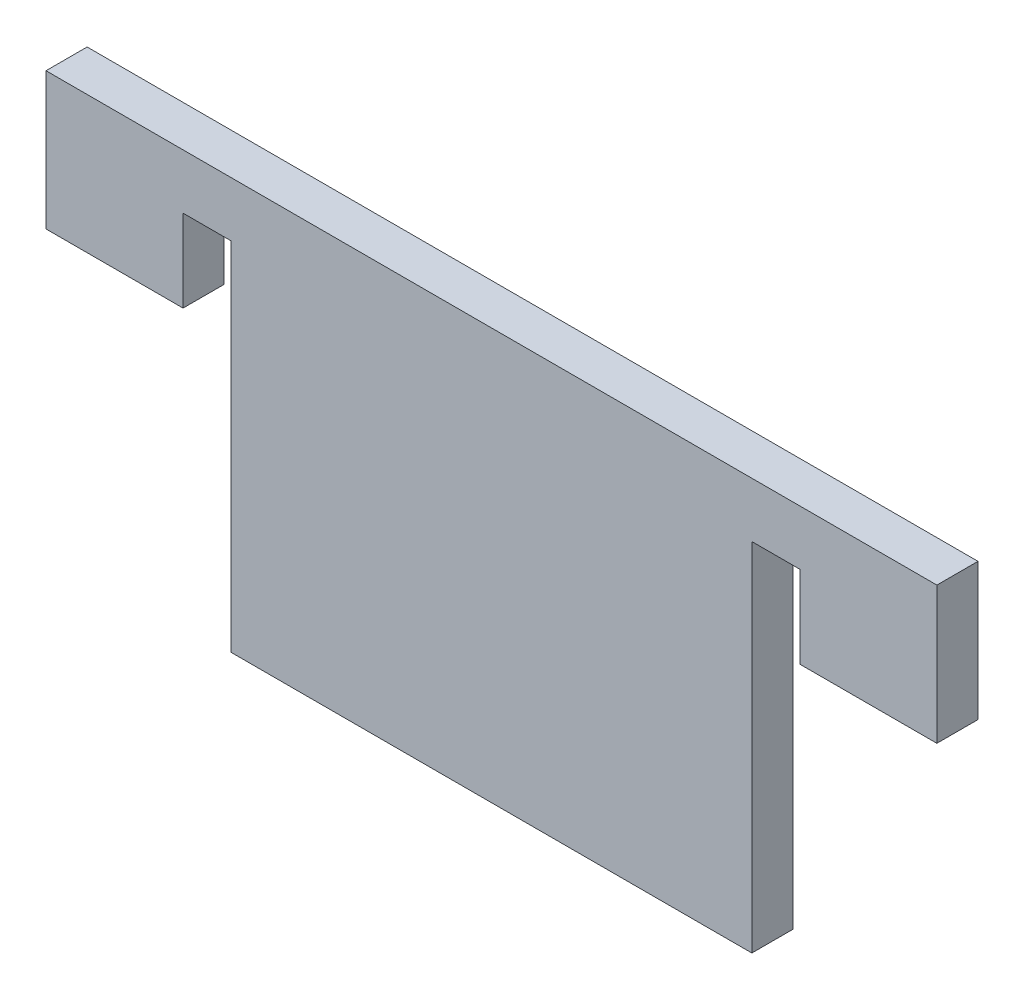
ISO-10303-21;
HEADER;
FILE_DESCRIPTION(('STEP AP214'),'2;1');
FILE_NAME('part.step','',(''),(''),'','','');
FILE_SCHEMA(('AUTOMOTIVE_DESIGN { 1 0 10303 214 1 1 1 1 }'));
ENDSEC;
DATA;
#1=APPLICATION_CONTEXT('core data for automotive mechanical design processes');
#2=APPLICATION_PROTOCOL_DEFINITION('international standard','automotive_design',2000,#1);
#3=PRODUCT_CONTEXT('',#1,'mechanical');
#4=PRODUCT('Part','Part','',(#3));
#5=PRODUCT_RELATED_PRODUCT_CATEGORY('part','',(#4));
#6=PRODUCT_DEFINITION_FORMATION('','',#4);
#7=PRODUCT_DEFINITION_CONTEXT('part definition',#1,'design');
#8=PRODUCT_DEFINITION('design','',#6,#7);
#9=PRODUCT_DEFINITION_SHAPE('','',#8);
#10=(LENGTH_UNIT() NAMED_UNIT(*) SI_UNIT(.MILLI.,.METRE.));
#11=(NAMED_UNIT(*) PLANE_ANGLE_UNIT() SI_UNIT($,.RADIAN.));
#12=(NAMED_UNIT(*) SI_UNIT($,.STERADIAN.) SOLID_ANGLE_UNIT());
#13=UNCERTAINTY_MEASURE_WITH_UNIT(LENGTH_MEASURE(1.E-05),#10,'distance_accuracy_value','');
#14=(GEOMETRIC_REPRESENTATION_CONTEXT(3) GLOBAL_UNCERTAINTY_ASSIGNED_CONTEXT((#13)) GLOBAL_UNIT_ASSIGNED_CONTEXT((#10,
#11,#12)) REPRESENTATION_CONTEXT('',''));
#15=CARTESIAN_POINT('',(0.,0.,0.));
#16=DIRECTION('',(0.,0.,1.));
#17=DIRECTION('',(1.,0.,0.));
#18=AXIS2_PLACEMENT_3D('',#15,#16,#17);
#19=CARTESIAN_POINT('',(0.,0.,3.));
#20=DIRECTION('',(1.,0.,0.));
#21=DIRECTION('',(0.,0.,-1.));
#22=AXIS2_PLACEMENT_3D('',#19,#20,#21);
#23=PLANE('',#22);
#24=DIRECTION('',(0.,-1.,0.));
#25=VECTOR('',#24,1.);
#26=CARTESIAN_POINT('',(0.,0.,0.));
#27=LINE('',#26,#25);
#28=CARTESIAN_POINT('',(0.,30.,0.));
#29=VERTEX_POINT('',#28);
#30=CARTESIAN_POINT('',(0.,20.,0.));
#31=VERTEX_POINT('',#30);
#32=EDGE_CURVE('E80',#29,#31,#27,.T.);
#33=ORIENTED_EDGE('',*,*,#32,.T.);
#34=DIRECTION('',(0.,0.,1.));
#35=VECTOR('',#34,1.);
#36=CARTESIAN_POINT('',(0.,20.,0.));
#37=LINE('',#36,#35);
#38=CARTESIAN_POINT('',(0.,20.,3.));
#39=VERTEX_POINT('',#38);
#40=EDGE_CURVE('E89',#31,#39,#37,.T.);
#41=ORIENTED_EDGE('',*,*,#40,.T.);
#42=DIRECTION('',(0.,-1.,0.));
#43=VECTOR('',#42,1.);
#44=CARTESIAN_POINT('',(0.,0.,3.));
#45=LINE('',#44,#43);
#46=CARTESIAN_POINT('',(0.,30.,3.));
#47=VERTEX_POINT('',#46);
#48=EDGE_CURVE('E74',#47,#39,#45,.T.);
#49=ORIENTED_EDGE('',*,*,#48,.F.);
#50=DIRECTION('',(0.,0.,-1.));
#51=VECTOR('',#50,1.);
#52=CARTESIAN_POINT('',(0.,30.,3.));
#53=LINE('',#52,#51);
#54=EDGE_CURVE('E38',#47,#29,#53,.T.);
#55=ORIENTED_EDGE('',*,*,#54,.T.);
#56=EDGE_LOOP('',(#33,#41,#49,#55));
#57=FACE_BOUND('',#56,.T.);
#58=ADVANCED_FACE('F31',(#57),#23,.F.);
#59=CARTESIAN_POINT('',(0.,0.,3.));
#60=DIRECTION('',(0.,1.,0.));
#61=DIRECTION('',(0.,0.,1.));
#62=AXIS2_PLACEMENT_3D('',#59,#60,#61);
#63=PLANE('',#62);
#64=DIRECTION('',(1.,0.,0.));
#65=VECTOR('',#64,1.);
#66=CARTESIAN_POINT('',(0.,0.,0.));
#67=LINE('',#66,#65);
#68=CARTESIAN_POINT('',(13.5,0.,0.));
#69=VERTEX_POINT('',#68);
#70=CARTESIAN_POINT('',(51.5,0.,0.));
#71=VERTEX_POINT('',#70);
#72=EDGE_CURVE('E88',#69,#71,#67,.T.);
#73=ORIENTED_EDGE('',*,*,#72,.T.);
#74=DIRECTION('',(0.,0.,1.));
#75=VECTOR('',#74,1.);
#76=CARTESIAN_POINT('',(51.5,0.,0.));
#77=LINE('',#76,#75);
#78=CARTESIAN_POINT('',(51.5,0.,3.));
#79=VERTEX_POINT('',#78);
#80=EDGE_CURVE('E167',#71,#79,#77,.T.);
#81=ORIENTED_EDGE('',*,*,#80,.T.);
#82=DIRECTION('',(1.,0.,0.));
#83=VECTOR('',#82,1.);
#84=CARTESIAN_POINT('',(0.,0.,3.));
#85=LINE('',#84,#83);
#86=CARTESIAN_POINT('',(13.5,0.,3.));
#87=VERTEX_POINT('',#86);
#88=EDGE_CURVE('E144',#87,#79,#85,.T.);
#89=ORIENTED_EDGE('',*,*,#88,.F.);
#90=DIRECTION('',(0.,0.,1.));
#91=VECTOR('',#90,1.);
#92=CARTESIAN_POINT('',(13.5,0.,0.));
#93=LINE('',#92,#91);
#94=EDGE_CURVE('E93',#69,#87,#93,.T.);
#95=ORIENTED_EDGE('',*,*,#94,.F.);
#96=EDGE_LOOP('',(#73,#81,#89,#95));
#97=FACE_BOUND('',#96,.T.);
#98=ADVANCED_FACE('F219',(#97),#63,.F.);
#99=CARTESIAN_POINT('',(65.,0.,3.));
#100=DIRECTION('',(-1.,0.,0.));
#101=DIRECTION('',(0.,0.,1.));
#102=AXIS2_PLACEMENT_3D('',#99,#100,#101);
#103=PLANE('',#102);
#104=DIRECTION('',(0.,1.,0.));
#105=VECTOR('',#104,1.);
#106=CARTESIAN_POINT('',(65.,0.,3.));
#107=LINE('',#106,#105);
#108=CARTESIAN_POINT('',(65.,20.,3.));
#109=VERTEX_POINT('',#108);
#110=CARTESIAN_POINT('',(65.,30.,3.));
#111=VERTEX_POINT('',#110);
#112=EDGE_CURVE('E147',#109,#111,#107,.T.);
#113=ORIENTED_EDGE('',*,*,#112,.F.);
#114=DIRECTION('',(0.,0.,1.));
#115=VECTOR('',#114,1.);
#116=CARTESIAN_POINT('',(65.,20.,0.));
#117=LINE('',#116,#115);
#118=CARTESIAN_POINT('',(65.,20.,0.));
#119=VERTEX_POINT('',#118);
#120=EDGE_CURVE('E104',#119,#109,#117,.T.);
#121=ORIENTED_EDGE('',*,*,#120,.F.);
#122=DIRECTION('',(0.,1.,0.));
#123=VECTOR('',#122,1.);
#124=CARTESIAN_POINT('',(65.,0.,0.));
#125=LINE('',#124,#123);
#126=CARTESIAN_POINT('',(65.,30.,0.));
#127=VERTEX_POINT('',#126);
#128=EDGE_CURVE('E75',#119,#127,#125,.T.);
#129=ORIENTED_EDGE('',*,*,#128,.T.);
#130=DIRECTION('',(0.,0.,-1.));
#131=VECTOR('',#130,1.);
#132=CARTESIAN_POINT('',(65.,30.,3.));
#133=LINE('',#132,#131);
#134=EDGE_CURVE('E11',#111,#127,#133,.T.);
#135=ORIENTED_EDGE('',*,*,#134,.F.);
#136=EDGE_LOOP('',(#113,#121,#129,#135));
#137=FACE_BOUND('',#136,.T.);
#138=ADVANCED_FACE('F101',(#137),#103,.F.);
#139=CARTESIAN_POINT('',(0.,30.,3.));
#140=DIRECTION('',(0.,-1.,0.));
#141=DIRECTION('',(0.,0.,-1.));
#142=AXIS2_PLACEMENT_3D('',#139,#140,#141);
#143=PLANE('',#142);
#144=DIRECTION('',(-1.,0.,0.));
#145=VECTOR('',#144,1.);
#146=CARTESIAN_POINT('',(0.,30.,0.));
#147=LINE('',#146,#145);
#148=EDGE_CURVE('E66',#127,#29,#147,.T.);
#149=ORIENTED_EDGE('',*,*,#148,.T.);
#150=ORIENTED_EDGE('',*,*,#54,.F.);
#151=DIRECTION('',(-1.,0.,0.));
#152=VECTOR('',#151,1.);
#153=CARTESIAN_POINT('',(0.,30.,3.));
#154=LINE('',#153,#152);
#155=EDGE_CURVE('E54',#111,#47,#154,.T.);
#156=ORIENTED_EDGE('',*,*,#155,.F.);
#157=ORIENTED_EDGE('',*,*,#134,.T.);
#158=EDGE_LOOP('',(#149,#150,#156,#157));
#159=FACE_BOUND('',#158,.T.);
#160=ADVANCED_FACE('F68',(#159),#143,.F.);
#161=CARTESIAN_POINT('',(0.,30.,3.));
#162=DIRECTION('',(0.,0.,-1.));
#163=DIRECTION('',(-1.,0.,0.));
#164=AXIS2_PLACEMENT_3D('',#161,#162,#163);
#165=PLANE('',#164);
#166=DIRECTION('',(0.,-1.,0.));
#167=VECTOR('',#166,1.);
#168=CARTESIAN_POINT('',(51.5,0.,3.));
#169=LINE('',#168,#167);
#170=CARTESIAN_POINT('',(51.5,26.,3.));
#171=VERTEX_POINT('',#170);
#172=EDGE_CURVE('E158',#171,#79,#169,.T.);
#173=ORIENTED_EDGE('',*,*,#172,.F.);
#174=DIRECTION('',(-1.,0.,0.));
#175=VECTOR('',#174,1.);
#176=CARTESIAN_POINT('',(51.5,26.,3.));
#177=LINE('',#176,#175);
#178=CARTESIAN_POINT('',(55.,26.,3.));
#179=VERTEX_POINT('',#178);
#180=EDGE_CURVE('E223',#179,#171,#177,.T.);
#181=ORIENTED_EDGE('',*,*,#180,.F.);
#182=DIRECTION('',(0.,1.,0.));
#183=VECTOR('',#182,1.);
#184=CARTESIAN_POINT('',(55.,20.,3.));
#185=LINE('',#184,#183);
#186=CARTESIAN_POINT('',(55.,20.,3.));
#187=VERTEX_POINT('',#186);
#188=EDGE_CURVE('E157',#187,#179,#185,.T.);
#189=ORIENTED_EDGE('',*,*,#188,.F.);
#190=DIRECTION('',(-1.,0.,0.));
#191=VECTOR('',#190,1.);
#192=CARTESIAN_POINT('',(65.,20.,3.));
#193=LINE('',#192,#191);
#194=EDGE_CURVE('E153',#109,#187,#193,.T.);
#195=ORIENTED_EDGE('',*,*,#194,.F.);
#196=ORIENTED_EDGE('',*,*,#112,.T.);
#197=ORIENTED_EDGE('',*,*,#155,.T.);
#198=ORIENTED_EDGE('',*,*,#48,.T.);
#199=DIRECTION('',(-1.,0.,0.));
#200=VECTOR('',#199,1.);
#201=CARTESIAN_POINT('',(0.,20.,3.));
#202=LINE('',#201,#200);
#203=CARTESIAN_POINT('',(10.,20.,3.));
#204=VERTEX_POINT('',#203);
#205=EDGE_CURVE('E134',#204,#39,#202,.T.);
#206=ORIENTED_EDGE('',*,*,#205,.F.);
#207=DIRECTION('',(0.,-1.,0.));
#208=VECTOR('',#207,1.);
#209=CARTESIAN_POINT('',(10.,20.,3.));
#210=LINE('',#209,#208);
#211=CARTESIAN_POINT('',(10.,26.,3.));
#212=VERTEX_POINT('',#211);
#213=EDGE_CURVE('E200',#212,#204,#210,.T.);
#214=ORIENTED_EDGE('',*,*,#213,.F.);
#215=DIRECTION('',(-1.,0.,0.));
#216=VECTOR('',#215,1.);
#217=CARTESIAN_POINT('',(13.5,26.,3.));
#218=LINE('',#217,#216);
#219=CARTESIAN_POINT('',(13.5,26.,3.));
#220=VERTEX_POINT('',#219);
#221=EDGE_CURVE('E194',#220,#212,#218,.T.);
#222=ORIENTED_EDGE('',*,*,#221,.F.);
#223=DIRECTION('',(0.,1.,0.));
#224=VECTOR('',#223,1.);
#225=CARTESIAN_POINT('',(13.5,0.,3.));
#226=LINE('',#225,#224);
#227=EDGE_CURVE('E140',#87,#220,#226,.T.);
#228=ORIENTED_EDGE('',*,*,#227,.F.);
#229=ORIENTED_EDGE('',*,*,#88,.T.);
#230=EDGE_LOOP('',(#173,#181,#189,#195,#196,#197,#198,#206,#214,#222,#228,#229));
#231=FACE_BOUND('',#230,.T.);
#232=ADVANCED_FACE('F143',(#231),#165,.F.);
#233=CARTESIAN_POINT('',(0.,30.,0.));
#234=DIRECTION('',(0.,0.,-1.));
#235=DIRECTION('',(-1.,0.,0.));
#236=AXIS2_PLACEMENT_3D('',#233,#234,#235);
#237=PLANE('',#236);
#238=DIRECTION('',(-1.,0.,0.));
#239=VECTOR('',#238,1.);
#240=CARTESIAN_POINT('',(51.5,26.,0.));
#241=LINE('',#240,#239);
#242=CARTESIAN_POINT('',(55.,26.,0.));
#243=VERTEX_POINT('',#242);
#244=CARTESIAN_POINT('',(51.5,26.,0.));
#245=VERTEX_POINT('',#244);
#246=EDGE_CURVE('E215',#243,#245,#241,.T.);
#247=ORIENTED_EDGE('',*,*,#246,.T.);
#248=DIRECTION('',(0.,-1.,0.));
#249=VECTOR('',#248,1.);
#250=CARTESIAN_POINT('',(51.5,0.,0.));
#251=LINE('',#250,#249);
#252=EDGE_CURVE('E164',#245,#71,#251,.T.);
#253=ORIENTED_EDGE('',*,*,#252,.T.);
#254=ORIENTED_EDGE('',*,*,#72,.F.);
#255=DIRECTION('',(0.,1.,0.));
#256=VECTOR('',#255,1.);
#257=CARTESIAN_POINT('',(13.5,0.,0.));
#258=LINE('',#257,#256);
#259=CARTESIAN_POINT('',(13.5,26.,0.));
#260=VERTEX_POINT('',#259);
#261=EDGE_CURVE('E139',#69,#260,#258,.T.);
#262=ORIENTED_EDGE('',*,*,#261,.T.);
#263=DIRECTION('',(-1.,0.,0.));
#264=VECTOR('',#263,1.);
#265=CARTESIAN_POINT('',(13.5,26.,0.));
#266=LINE('',#265,#264);
#267=CARTESIAN_POINT('',(10.,26.,0.));
#268=VERTEX_POINT('',#267);
#269=EDGE_CURVE('E196',#260,#268,#266,.T.);
#270=ORIENTED_EDGE('',*,*,#269,.T.);
#271=DIRECTION('',(0.,-1.,0.));
#272=VECTOR('',#271,1.);
#273=CARTESIAN_POINT('',(10.,20.,0.));
#274=LINE('',#273,#272);
#275=CARTESIAN_POINT('',(10.,20.,0.));
#276=VERTEX_POINT('',#275);
#277=EDGE_CURVE('E197',#268,#276,#274,.T.);
#278=ORIENTED_EDGE('',*,*,#277,.T.);
#279=DIRECTION('',(-1.,0.,0.));
#280=VECTOR('',#279,1.);
#281=CARTESIAN_POINT('',(0.,20.,0.));
#282=LINE('',#281,#280);
#283=EDGE_CURVE('E86',#276,#31,#282,.T.);
#284=ORIENTED_EDGE('',*,*,#283,.T.);
#285=ORIENTED_EDGE('',*,*,#32,.F.);
#286=ORIENTED_EDGE('',*,*,#148,.F.);
#287=ORIENTED_EDGE('',*,*,#128,.F.);
#288=DIRECTION('',(-1.,0.,0.));
#289=VECTOR('',#288,1.);
#290=CARTESIAN_POINT('',(65.,20.,0.));
#291=LINE('',#290,#289);
#292=CARTESIAN_POINT('',(55.,20.,0.));
#293=VERTEX_POINT('',#292);
#294=EDGE_CURVE('E107',#119,#293,#291,.T.);
#295=ORIENTED_EDGE('',*,*,#294,.T.);
#296=DIRECTION('',(0.,1.,0.));
#297=VECTOR('',#296,1.);
#298=CARTESIAN_POINT('',(55.,20.,0.));
#299=LINE('',#298,#297);
#300=EDGE_CURVE('E45',#293,#243,#299,.T.);
#301=ORIENTED_EDGE('',*,*,#300,.T.);
#302=EDGE_LOOP('',(#247,#253,#254,#262,#270,#278,#284,#285,#286,#287,#295,#301));
#303=FACE_BOUND('',#302,.T.);
#304=ADVANCED_FACE('F83',(#303),#237,.T.);
#305=CARTESIAN_POINT('',(0.,20.,0.));
#306=DIRECTION('',(0.,1.,0.));
#307=DIRECTION('',(0.,0.,1.));
#308=AXIS2_PLACEMENT_3D('',#305,#306,#307);
#309=PLANE('',#308);
#310=ORIENTED_EDGE('',*,*,#283,.F.);
#311=DIRECTION('',(0.,0.,1.));
#312=VECTOR('',#311,1.);
#313=CARTESIAN_POINT('',(10.,20.,0.));
#314=LINE('',#313,#312);
#315=EDGE_CURVE('E137',#276,#204,#314,.T.);
#316=ORIENTED_EDGE('',*,*,#315,.T.);
#317=ORIENTED_EDGE('',*,*,#205,.T.);
#318=ORIENTED_EDGE('',*,*,#40,.F.);
#319=EDGE_LOOP('',(#310,#316,#317,#318));
#320=FACE_BOUND('',#319,.T.);
#321=ADVANCED_FACE('F135',(#320),#309,.F.);
#322=CARTESIAN_POINT('',(13.5,0.,0.));
#323=DIRECTION('',(1.,0.,0.));
#324=DIRECTION('',(0.,0.,-1.));
#325=AXIS2_PLACEMENT_3D('',#322,#323,#324);
#326=PLANE('',#325);
#327=ORIENTED_EDGE('',*,*,#227,.T.);
#328=DIRECTION('',(0.,0.,1.));
#329=VECTOR('',#328,1.);
#330=CARTESIAN_POINT('',(13.5,26.,0.));
#331=LINE('',#330,#329);
#332=EDGE_CURVE('E182',#260,#220,#331,.T.);
#333=ORIENTED_EDGE('',*,*,#332,.F.);
#334=ORIENTED_EDGE('',*,*,#261,.F.);
#335=ORIENTED_EDGE('',*,*,#94,.T.);
#336=EDGE_LOOP('',(#327,#333,#334,#335));
#337=FACE_BOUND('',#336,.T.);
#338=ADVANCED_FACE('F180',(#337),#326,.F.);
#339=CARTESIAN_POINT('',(51.5,0.,0.));
#340=DIRECTION('',(-1.,0.,0.));
#341=DIRECTION('',(0.,0.,1.));
#342=AXIS2_PLACEMENT_3D('',#339,#340,#341);
#343=PLANE('',#342);
#344=ORIENTED_EDGE('',*,*,#172,.T.);
#345=ORIENTED_EDGE('',*,*,#80,.F.);
#346=ORIENTED_EDGE('',*,*,#252,.F.);
#347=DIRECTION('',(0.,0.,1.));
#348=VECTOR('',#347,1.);
#349=CARTESIAN_POINT('',(51.5,26.,0.));
#350=LINE('',#349,#348);
#351=EDGE_CURVE('E201',#245,#171,#350,.T.);
#352=ORIENTED_EDGE('',*,*,#351,.T.);
#353=EDGE_LOOP('',(#344,#345,#346,#352));
#354=FACE_BOUND('',#353,.T.);
#355=ADVANCED_FACE('F226',(#354),#343,.F.);
#356=CARTESIAN_POINT('',(65.,20.,0.));
#357=DIRECTION('',(0.,1.,0.));
#358=DIRECTION('',(0.,0.,1.));
#359=AXIS2_PLACEMENT_3D('',#356,#357,#358);
#360=PLANE('',#359);
#361=ORIENTED_EDGE('',*,*,#194,.T.);
#362=DIRECTION('',(0.,0.,1.));
#363=VECTOR('',#362,1.);
#364=CARTESIAN_POINT('',(55.,20.,0.));
#365=LINE('',#364,#363);
#366=EDGE_CURVE('E236',#293,#187,#365,.T.);
#367=ORIENTED_EDGE('',*,*,#366,.F.);
#368=ORIENTED_EDGE('',*,*,#294,.F.);
#369=ORIENTED_EDGE('',*,*,#120,.T.);
#370=EDGE_LOOP('',(#361,#367,#368,#369));
#371=FACE_BOUND('',#370,.T.);
#372=ADVANCED_FACE('F249',(#371),#360,.F.);
#373=CARTESIAN_POINT('',(10.,20.,0.));
#374=DIRECTION('',(-1.,0.,0.));
#375=DIRECTION('',(0.,0.,1.));
#376=AXIS2_PLACEMENT_3D('',#373,#374,#375);
#377=PLANE('',#376);
#378=ORIENTED_EDGE('',*,*,#213,.T.);
#379=ORIENTED_EDGE('',*,*,#315,.F.);
#380=ORIENTED_EDGE('',*,*,#277,.F.);
#381=DIRECTION('',(0.,0.,1.));
#382=VECTOR('',#381,1.);
#383=CARTESIAN_POINT('',(10.,26.,0.));
#384=LINE('',#383,#382);
#385=EDGE_CURVE('E161',#268,#212,#384,.T.);
#386=ORIENTED_EDGE('',*,*,#385,.T.);
#387=EDGE_LOOP('',(#378,#379,#380,#386));
#388=FACE_BOUND('',#387,.T.);
#389=ADVANCED_FACE('F241',(#388),#377,.F.);
#390=CARTESIAN_POINT('',(13.5,26.,0.));
#391=DIRECTION('',(0.,1.,0.));
#392=DIRECTION('',(0.,0.,1.));
#393=AXIS2_PLACEMENT_3D('',#390,#391,#392);
#394=PLANE('',#393);
#395=ORIENTED_EDGE('',*,*,#221,.T.);
#396=ORIENTED_EDGE('',*,*,#385,.F.);
#397=ORIENTED_EDGE('',*,*,#269,.F.);
#398=ORIENTED_EDGE('',*,*,#332,.T.);
#399=EDGE_LOOP('',(#395,#396,#397,#398));
#400=FACE_BOUND('',#399,.T.);
#401=ADVANCED_FACE('F192',(#400),#394,.F.);
#402=CARTESIAN_POINT('',(51.5,26.,0.));
#403=DIRECTION('',(0.,1.,0.));
#404=DIRECTION('',(0.,0.,1.));
#405=AXIS2_PLACEMENT_3D('',#402,#403,#404);
#406=PLANE('',#405);
#407=ORIENTED_EDGE('',*,*,#180,.T.);
#408=ORIENTED_EDGE('',*,*,#351,.F.);
#409=ORIENTED_EDGE('',*,*,#246,.F.);
#410=DIRECTION('',(0.,0.,1.));
#411=VECTOR('',#410,1.);
#412=CARTESIAN_POINT('',(55.,26.,0.));
#413=LINE('',#412,#411);
#414=EDGE_CURVE('E205',#243,#179,#413,.T.);
#415=ORIENTED_EDGE('',*,*,#414,.T.);
#416=EDGE_LOOP('',(#407,#408,#409,#415));
#417=FACE_BOUND('',#416,.T.);
#418=ADVANCED_FACE('F229',(#417),#406,.F.);
#419=CARTESIAN_POINT('',(55.,20.,0.));
#420=DIRECTION('',(1.,0.,0.));
#421=DIRECTION('',(0.,0.,-1.));
#422=AXIS2_PLACEMENT_3D('',#419,#420,#421);
#423=PLANE('',#422);
#424=ORIENTED_EDGE('',*,*,#188,.T.);
#425=ORIENTED_EDGE('',*,*,#414,.F.);
#426=ORIENTED_EDGE('',*,*,#300,.F.);
#427=ORIENTED_EDGE('',*,*,#366,.T.);
#428=EDGE_LOOP('',(#424,#425,#426,#427));
#429=FACE_BOUND('',#428,.T.);
#430=ADVANCED_FACE('F248',(#429),#423,.F.);
#431=CLOSED_SHELL('',(#58,#98,#138,#160,#232,#304,#321,#338,#355,#372,#389,#401,#418,#430));
#432=MANIFOLD_SOLID_BREP('B2',#431);
#433=ADVANCED_BREP_SHAPE_REPRESENTATION('',(#18,#432),#14);
#434=SHAPE_DEFINITION_REPRESENTATION(#9,#433);
ENDSEC;
END-ISO-10303-21;
